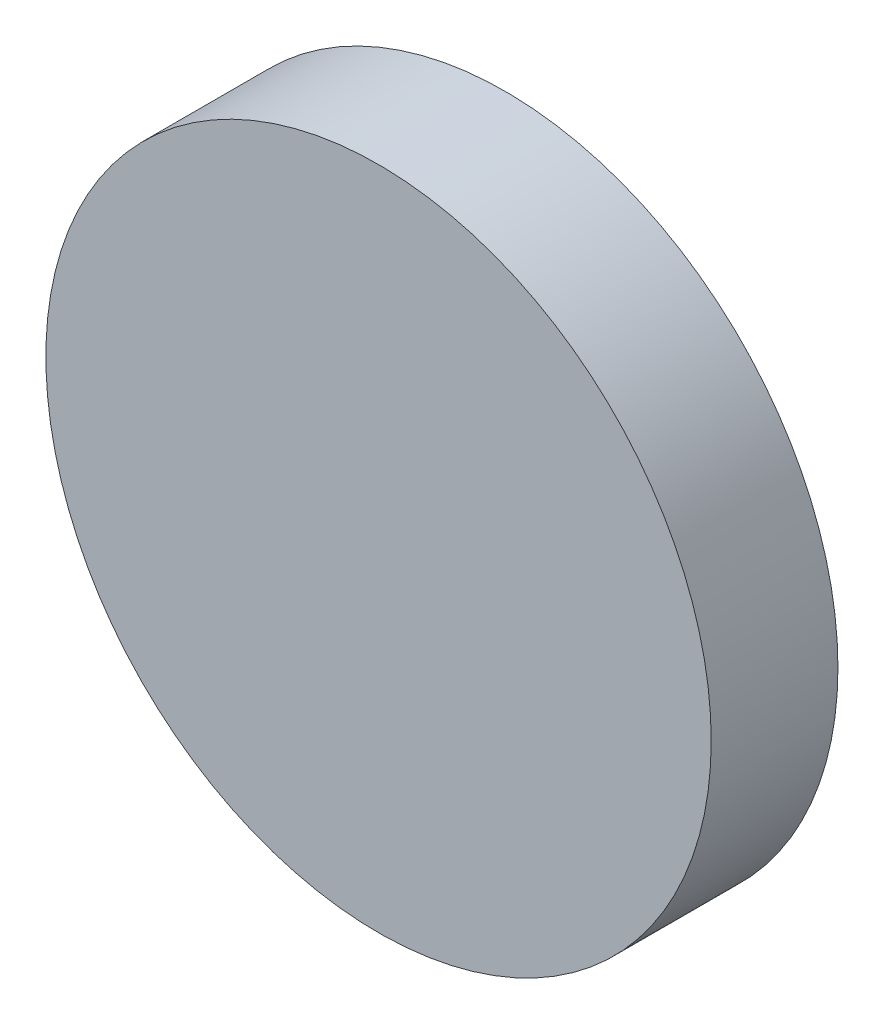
from build123d import *

# Parameters (mm, degrees)
SKETCH1_R           = 52.5
BOSS_EXTRUDE1_DEPTH = 20


with BuildPart() as part:
    # Sketch1 → Boss-Extrude1 (new body)
    with BuildSketch(Plane.XY):
        Circle(SKETCH1_R)
    extrude(amount=BOSS_EXTRUDE1_DEPTH)


solid = part.part
